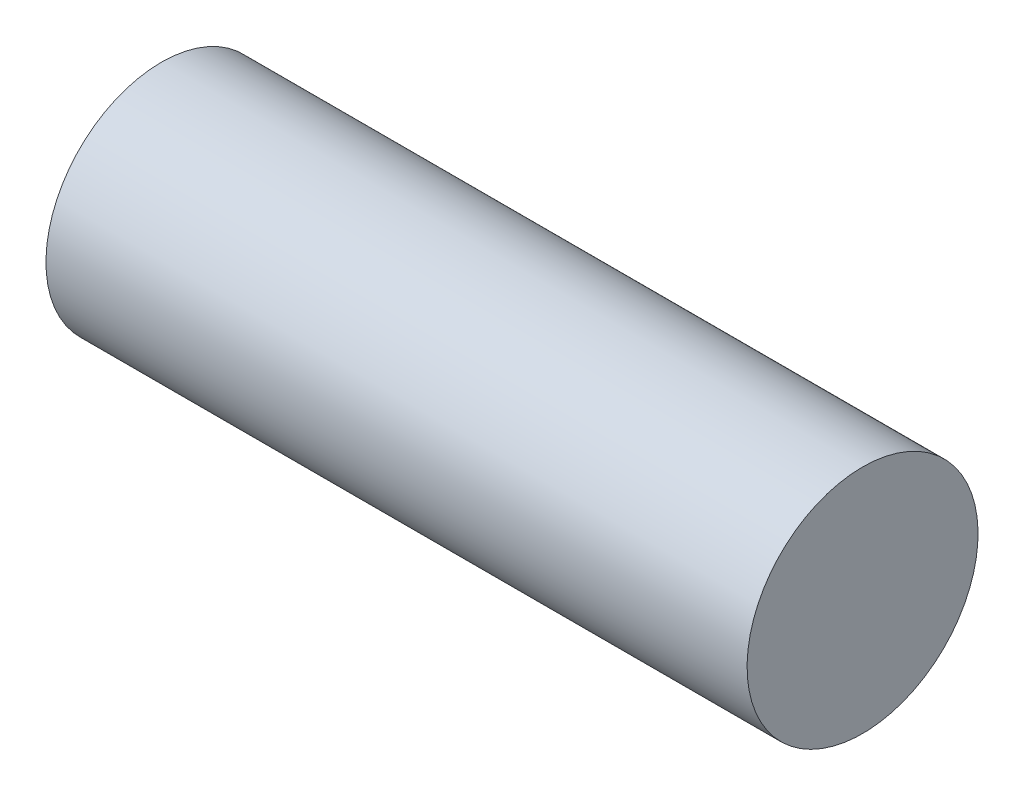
from build123d import *

# Parameters (mm, degrees)
SKETCH1_W = 255
SKETCH1_H = 42


with BuildPart() as part:
    # Sketch1 → Revolve1 (revolve)
    with BuildSketch(Plane.XY):
        with Locations((-127.5, 21)):
            Rectangle(SKETCH1_W, SKETCH1_H)
    revolve(axis=Axis((0, 0, 0), (-1, 0, 0)))


solid = part.part
